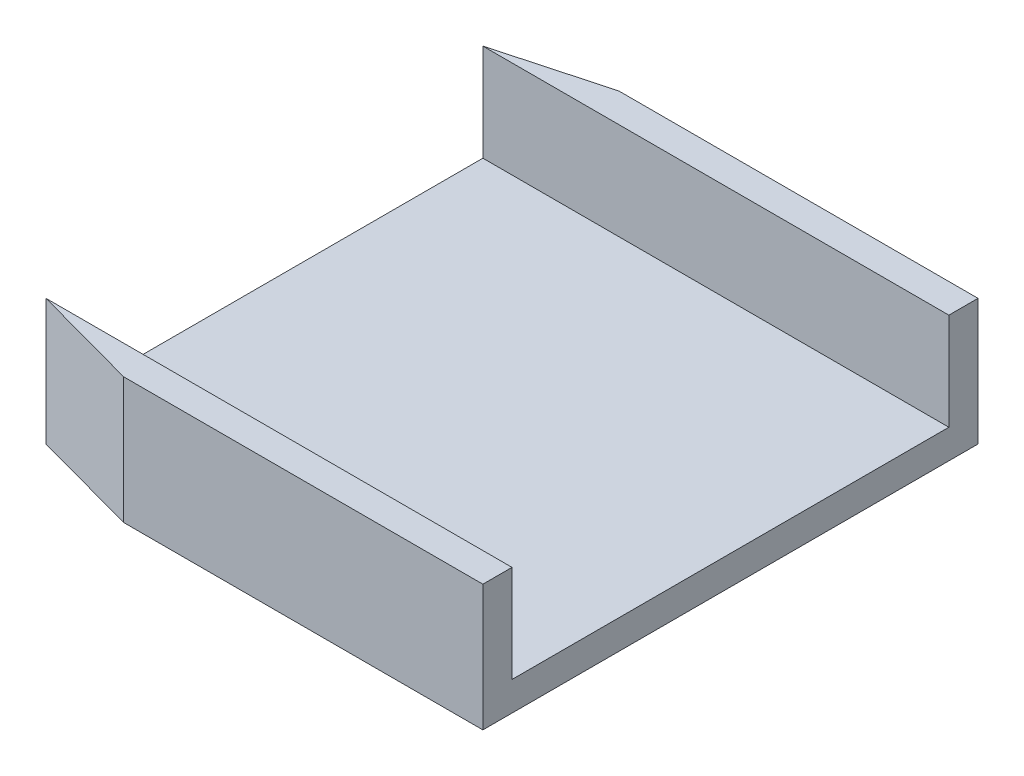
ISO-10303-21;
HEADER;
FILE_DESCRIPTION(('STEP AP214'),'2;1');
FILE_NAME('part.step','',(''),(''),'','','');
FILE_SCHEMA(('AUTOMOTIVE_DESIGN { 1 0 10303 214 1 1 1 1 }'));
ENDSEC;
DATA;
#1=APPLICATION_CONTEXT('core data for automotive mechanical design processes');
#2=APPLICATION_PROTOCOL_DEFINITION('international standard','automotive_design',2000,#1);
#3=PRODUCT_CONTEXT('',#1,'mechanical');
#4=PRODUCT('Part','Part','',(#3));
#5=PRODUCT_RELATED_PRODUCT_CATEGORY('part','',(#4));
#6=PRODUCT_DEFINITION_FORMATION('','',#4);
#7=PRODUCT_DEFINITION_CONTEXT('part definition',#1,'design');
#8=PRODUCT_DEFINITION('design','',#6,#7);
#9=PRODUCT_DEFINITION_SHAPE('','',#8);
#10=(LENGTH_UNIT() NAMED_UNIT(*) SI_UNIT(.MILLI.,.METRE.));
#11=(NAMED_UNIT(*) PLANE_ANGLE_UNIT() SI_UNIT($,.RADIAN.));
#12=(NAMED_UNIT(*) SI_UNIT($,.STERADIAN.) SOLID_ANGLE_UNIT());
#13=UNCERTAINTY_MEASURE_WITH_UNIT(LENGTH_MEASURE(1.E-05),#10,'distance_accuracy_value','');
#14=(GEOMETRIC_REPRESENTATION_CONTEXT(3) GLOBAL_UNCERTAINTY_ASSIGNED_CONTEXT((#13)) GLOBAL_UNIT_ASSIGNED_CONTEXT((#10,
#11,#12)) REPRESENTATION_CONTEXT('',''));
#15=CARTESIAN_POINT('',(0.,0.,0.));
#16=DIRECTION('',(0.,0.,1.));
#17=DIRECTION('',(1.,0.,0.));
#18=AXIS2_PLACEMENT_3D('',#15,#16,#17);
#19=CARTESIAN_POINT('',(0.,3.,0.));
#20=DIRECTION('',(0.,-1.,0.));
#21=DIRECTION('',(0.,0.,-1.));
#22=AXIS2_PLACEMENT_3D('',#19,#20,#21);
#23=PLANE('',#22);
#24=DIRECTION('',(1.,0.,0.));
#25=VECTOR('',#24,1.);
#26=CARTESIAN_POINT('',(48.,3.,-45.));
#27=LINE('',#26,#25);
#28=CARTESIAN_POINT('',(0.,3.,-45.));
#29=VERTEX_POINT('',#28);
#30=CARTESIAN_POINT('',(48.,3.,-45.));
#31=VERTEX_POINT('',#30);
#32=EDGE_CURVE('E124',#29,#31,#27,.T.);
#33=ORIENTED_EDGE('',*,*,#32,.F.);
#34=DIRECTION('',(0.,0.,1.));
#35=VECTOR('',#34,1.);
#36=CARTESIAN_POINT('',(0.,3.,0.));
#37=LINE('',#36,#35);
#38=CARTESIAN_POINT('',(0.,3.,0.));
#39=VERTEX_POINT('',#38);
#40=EDGE_CURVE('E150',#29,#39,#37,.T.);
#41=ORIENTED_EDGE('',*,*,#40,.T.);
#42=DIRECTION('',(-1.,0.,0.));
#43=VECTOR('',#42,1.);
#44=CARTESIAN_POINT('',(0.,3.,0.));
#45=LINE('',#44,#43);
#46=CARTESIAN_POINT('',(48.,3.,0.));
#47=VERTEX_POINT('',#46);
#48=EDGE_CURVE('E53',#47,#39,#45,.T.);
#49=ORIENTED_EDGE('',*,*,#48,.F.);
#50=DIRECTION('',(0.,0.,-1.));
#51=VECTOR('',#50,1.);
#52=CARTESIAN_POINT('',(48.,3.,3.));
#53=LINE('',#52,#51);
#54=EDGE_CURVE('E48',#47,#31,#53,.T.);
#55=ORIENTED_EDGE('',*,*,#54,.T.);
#56=EDGE_LOOP('',(#33,#41,#49,#55));
#57=FACE_BOUND('',#56,.T.);
#58=ADVANCED_FACE('F33',(#57),#23,.F.);
#59=CARTESIAN_POINT('',(0.,3.,0.));
#60=DIRECTION('',(1.,0.,0.));
#61=DIRECTION('',(0.,0.,-1.));
#62=AXIS2_PLACEMENT_3D('',#59,#60,#61);
#63=PLANE('',#62);
#64=DIRECTION('',(0.,0.,1.));
#65=VECTOR('',#64,1.);
#66=CARTESIAN_POINT('',(0.,0.,0.));
#67=LINE('',#66,#65);
#68=CARTESIAN_POINT('',(0.,0.,-45.));
#69=VERTEX_POINT('',#68);
#70=CARTESIAN_POINT('',(0.,0.,0.));
#71=VERTEX_POINT('',#70);
#72=EDGE_CURVE('E149',#69,#71,#67,.T.);
#73=ORIENTED_EDGE('',*,*,#72,.T.);
#74=DIRECTION('',(0.,-1.,0.));
#75=VECTOR('',#74,1.);
#76=CARTESIAN_POINT('',(0.,3.,0.));
#77=LINE('',#76,#75);
#78=EDGE_CURVE('E11',#39,#71,#77,.T.);
#79=ORIENTED_EDGE('',*,*,#78,.F.);
#80=ORIENTED_EDGE('',*,*,#40,.F.);
#81=DIRECTION('',(0.,-1.,0.));
#82=VECTOR('',#81,1.);
#83=CARTESIAN_POINT('',(0.,3.,-45.));
#84=LINE('',#83,#82);
#85=EDGE_CURVE('E154',#29,#69,#84,.T.);
#86=ORIENTED_EDGE('',*,*,#85,.T.);
#87=EDGE_LOOP('',(#73,#79,#80,#86));
#88=FACE_BOUND('',#87,.T.);
#89=ADVANCED_FACE('F35',(#88),#63,.F.);
#90=CARTESIAN_POINT('',(0.,3.,0.));
#91=DIRECTION('',(0.263117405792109,0.,-0.964763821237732));
#92=DIRECTION('',(-0.964763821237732,0.,-0.263117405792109));
#93=AXIS2_PLACEMENT_3D('',#90,#91,#92);
#94=PLANE('',#93);
#95=DIRECTION('',(0.964763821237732,0.,0.263117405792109));
#96=VECTOR('',#95,1.);
#97=CARTESIAN_POINT('',(0.,0.,0.));
#98=LINE('',#97,#96);
#99=CARTESIAN_POINT('',(11.,0.,3.));
#100=VERTEX_POINT('',#99);
#101=EDGE_CURVE('E157',#71,#100,#98,.T.);
#102=ORIENTED_EDGE('',*,*,#101,.T.);
#103=DIRECTION('',(0.,-1.,0.));
#104=VECTOR('',#103,1.);
#105=CARTESIAN_POINT('',(11.,3.,3.));
#106=LINE('',#105,#104);
#107=CARTESIAN_POINT('',(11.,13.,3.));
#108=VERTEX_POINT('',#107);
#109=EDGE_CURVE('E41',#108,#100,#106,.T.);
#110=ORIENTED_EDGE('',*,*,#109,.F.);
#111=DIRECTION('',(0.964763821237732,0.,0.263117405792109));
#112=VECTOR('',#111,1.);
#113=CARTESIAN_POINT('',(11.,13.,3.));
#114=LINE('',#113,#112);
#115=CARTESIAN_POINT('',(0.,13.,0.));
#116=VERTEX_POINT('',#115);
#117=EDGE_CURVE('E129',#116,#108,#114,.T.);
#118=ORIENTED_EDGE('',*,*,#117,.F.);
#119=DIRECTION('',(0.,-1.,0.));
#120=VECTOR('',#119,1.);
#121=CARTESIAN_POINT('',(0.,13.,0.));
#122=LINE('',#121,#120);
#123=EDGE_CURVE('E142',#116,#39,#122,.T.);
#124=ORIENTED_EDGE('',*,*,#123,.T.);
#125=ORIENTED_EDGE('',*,*,#78,.T.);
#126=EDGE_LOOP('',(#102,#110,#118,#124,#125));
#127=FACE_BOUND('',#126,.T.);
#128=ADVANCED_FACE('F201',(#127),#94,.F.);
#129=CARTESIAN_POINT('',(11.,3.,3.));
#130=DIRECTION('',(0.,0.,-1.));
#131=DIRECTION('',(-1.,0.,0.));
#132=AXIS2_PLACEMENT_3D('',#129,#130,#131);
#133=PLANE('',#132);
#134=DIRECTION('',(1.,0.,0.));
#135=VECTOR('',#134,1.);
#136=CARTESIAN_POINT('',(11.,0.,3.));
#137=LINE('',#136,#135);
#138=CARTESIAN_POINT('',(48.,0.,3.));
#139=VERTEX_POINT('',#138);
#140=EDGE_CURVE('E159',#100,#139,#137,.T.);
#141=ORIENTED_EDGE('',*,*,#140,.T.);
#142=DIRECTION('',(0.,-1.,0.));
#143=VECTOR('',#142,1.);
#144=CARTESIAN_POINT('',(48.,3.,3.));
#145=LINE('',#144,#143);
#146=CARTESIAN_POINT('',(48.,13.,3.));
#147=VERTEX_POINT('',#146);
#148=EDGE_CURVE('E173',#147,#139,#145,.T.);
#149=ORIENTED_EDGE('',*,*,#148,.F.);
#150=DIRECTION('',(1.,0.,0.));
#151=VECTOR('',#150,1.);
#152=CARTESIAN_POINT('',(48.,13.,3.));
#153=LINE('',#152,#151);
#154=EDGE_CURVE('E136',#108,#147,#153,.T.);
#155=ORIENTED_EDGE('',*,*,#154,.F.);
#156=ORIENTED_EDGE('',*,*,#109,.T.);
#157=EDGE_LOOP('',(#141,#149,#155,#156));
#158=FACE_BOUND('',#157,.T.);
#159=ADVANCED_FACE('F179',(#158),#133,.F.);
#160=CARTESIAN_POINT('',(48.,3.,-48.));
#161=DIRECTION('',(-1.,0.,0.));
#162=DIRECTION('',(0.,0.,1.));
#163=AXIS2_PLACEMENT_3D('',#160,#161,#162);
#164=PLANE('',#163);
#165=DIRECTION('',(0.,0.,-1.));
#166=VECTOR('',#165,1.);
#167=CARTESIAN_POINT('',(48.,0.,-48.));
#168=LINE('',#167,#166);
#169=CARTESIAN_POINT('',(48.,0.,-48.));
#170=VERTEX_POINT('',#169);
#171=EDGE_CURVE('E162',#139,#170,#168,.T.);
#172=ORIENTED_EDGE('',*,*,#171,.T.);
#173=DIRECTION('',(0.,-1.,0.));
#174=VECTOR('',#173,1.);
#175=CARTESIAN_POINT('',(48.,3.,-48.));
#176=LINE('',#175,#174);
#177=CARTESIAN_POINT('',(48.,13.,-48.));
#178=VERTEX_POINT('',#177);
#179=EDGE_CURVE('E110',#178,#170,#176,.T.);
#180=ORIENTED_EDGE('',*,*,#179,.F.);
#181=DIRECTION('',(0.,0.,-1.));
#182=VECTOR('',#181,1.);
#183=CARTESIAN_POINT('',(48.,13.,-48.));
#184=LINE('',#183,#182);
#185=CARTESIAN_POINT('',(48.,13.,-45.));
#186=VERTEX_POINT('',#185);
#187=EDGE_CURVE('E103',#186,#178,#184,.T.);
#188=ORIENTED_EDGE('',*,*,#187,.F.);
#189=DIRECTION('',(0.,-1.,0.));
#190=VECTOR('',#189,1.);
#191=CARTESIAN_POINT('',(48.,13.,-45.));
#192=LINE('',#191,#190);
#193=EDGE_CURVE('E107',#186,#31,#192,.T.);
#194=ORIENTED_EDGE('',*,*,#193,.T.);
#195=ORIENTED_EDGE('',*,*,#54,.F.);
#196=DIRECTION('',(0.,-1.,0.));
#197=VECTOR('',#196,1.);
#198=CARTESIAN_POINT('',(48.,13.,0.));
#199=LINE('',#198,#197);
#200=CARTESIAN_POINT('',(48.,13.,0.));
#201=VERTEX_POINT('',#200);
#202=EDGE_CURVE('E146',#201,#47,#199,.T.);
#203=ORIENTED_EDGE('',*,*,#202,.F.);
#204=DIRECTION('',(0.,0.,-1.));
#205=VECTOR('',#204,1.);
#206=CARTESIAN_POINT('',(48.,13.,0.));
#207=LINE('',#206,#205);
#208=EDGE_CURVE('E139',#147,#201,#207,.T.);
#209=ORIENTED_EDGE('',*,*,#208,.F.);
#210=ORIENTED_EDGE('',*,*,#148,.T.);
#211=EDGE_LOOP('',(#172,#180,#188,#194,#195,#203,#209,#210));
#212=FACE_BOUND('',#211,.T.);
#213=ADVANCED_FACE('F105',(#212),#164,.F.);
#214=CARTESIAN_POINT('',(11.,3.,-48.));
#215=DIRECTION('',(0.,0.,1.));
#216=DIRECTION('',(1.,0.,0.));
#217=AXIS2_PLACEMENT_3D('',#214,#215,#216);
#218=PLANE('',#217);
#219=DIRECTION('',(-1.,0.,0.));
#220=VECTOR('',#219,1.);
#221=CARTESIAN_POINT('',(11.,0.,-48.));
#222=LINE('',#221,#220);
#223=CARTESIAN_POINT('',(11.,0.,-48.));
#224=VERTEX_POINT('',#223);
#225=EDGE_CURVE('E164',#170,#224,#222,.T.);
#226=ORIENTED_EDGE('',*,*,#225,.T.);
#227=DIRECTION('',(0.,-1.,0.));
#228=VECTOR('',#227,1.);
#229=CARTESIAN_POINT('',(11.,3.,-48.));
#230=LINE('',#229,#228);
#231=CARTESIAN_POINT('',(11.,13.,-48.));
#232=VERTEX_POINT('',#231);
#233=EDGE_CURVE('E169',#232,#224,#230,.T.);
#234=ORIENTED_EDGE('',*,*,#233,.F.);
#235=DIRECTION('',(-1.,0.,0.));
#236=VECTOR('',#235,1.);
#237=CARTESIAN_POINT('',(11.,13.,-48.));
#238=LINE('',#237,#236);
#239=EDGE_CURVE('E114',#178,#232,#238,.T.);
#240=ORIENTED_EDGE('',*,*,#239,.F.);
#241=ORIENTED_EDGE('',*,*,#179,.T.);
#242=EDGE_LOOP('',(#226,#234,#240,#241));
#243=FACE_BOUND('',#242,.T.);
#244=ADVANCED_FACE('F189',(#243),#218,.F.);
#245=CARTESIAN_POINT('',(0.,3.,-45.));
#246=DIRECTION('',(0.263117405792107,0.,0.964763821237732));
#247=DIRECTION('',(0.964763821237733,0.,-0.263117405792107));
#248=AXIS2_PLACEMENT_3D('',#245,#246,#247);
#249=PLANE('',#248);
#250=DIRECTION('',(-0.964763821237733,0.,0.263117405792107));
#251=VECTOR('',#250,1.);
#252=CARTESIAN_POINT('',(0.,0.,-45.));
#253=LINE('',#252,#251);
#254=EDGE_CURVE('E152',#224,#69,#253,.T.);
#255=ORIENTED_EDGE('',*,*,#254,.T.);
#256=ORIENTED_EDGE('',*,*,#85,.F.);
#257=DIRECTION('',(0.,-1.,0.));
#258=VECTOR('',#257,1.);
#259=CARTESIAN_POINT('',(0.,13.,-45.));
#260=LINE('',#259,#258);
#261=CARTESIAN_POINT('',(0.,13.,-45.));
#262=VERTEX_POINT('',#261);
#263=EDGE_CURVE('E127',#262,#29,#260,.T.);
#264=ORIENTED_EDGE('',*,*,#263,.F.);
#265=DIRECTION('',(-0.964763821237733,0.,0.263117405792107));
#266=VECTOR('',#265,1.);
#267=CARTESIAN_POINT('',(0.,13.,-45.));
#268=LINE('',#267,#266);
#269=EDGE_CURVE('E120',#232,#262,#268,.T.);
#270=ORIENTED_EDGE('',*,*,#269,.F.);
#271=ORIENTED_EDGE('',*,*,#233,.T.);
#272=EDGE_LOOP('',(#255,#256,#264,#270,#271));
#273=FACE_BOUND('',#272,.T.);
#274=ADVANCED_FACE('F193',(#273),#249,.F.);
#275=CARTESIAN_POINT('',(0.,0.,0.));
#276=DIRECTION('',(0.,-1.,0.));
#277=DIRECTION('',(0.,0.,-1.));
#278=AXIS2_PLACEMENT_3D('',#275,#276,#277);
#279=PLANE('',#278);
#280=ORIENTED_EDGE('',*,*,#72,.F.);
#281=ORIENTED_EDGE('',*,*,#254,.F.);
#282=ORIENTED_EDGE('',*,*,#225,.F.);
#283=ORIENTED_EDGE('',*,*,#171,.F.);
#284=ORIENTED_EDGE('',*,*,#140,.F.);
#285=ORIENTED_EDGE('',*,*,#101,.F.);
#286=EDGE_LOOP('',(#280,#281,#282,#283,#284,#285));
#287=FACE_BOUND('',#286,.T.);
#288=ADVANCED_FACE('F184',(#287),#279,.T.);
#289=CARTESIAN_POINT('',(0.,13.,0.));
#290=DIRECTION('',(0.,0.,1.));
#291=DIRECTION('',(1.,0.,0.));
#292=AXIS2_PLACEMENT_3D('',#289,#290,#291);
#293=PLANE('',#292);
#294=ORIENTED_EDGE('',*,*,#48,.T.);
#295=ORIENTED_EDGE('',*,*,#123,.F.);
#296=DIRECTION('',(-1.,0.,0.));
#297=VECTOR('',#296,1.);
#298=CARTESIAN_POINT('',(0.,13.,0.));
#299=LINE('',#298,#297);
#300=EDGE_CURVE('E141',#201,#116,#299,.T.);
#301=ORIENTED_EDGE('',*,*,#300,.F.);
#302=ORIENTED_EDGE('',*,*,#202,.T.);
#303=EDGE_LOOP('',(#294,#295,#301,#302));
#304=FACE_BOUND('',#303,.T.);
#305=ADVANCED_FACE('F198',(#304),#293,.F.);
#306=CARTESIAN_POINT('',(0.,13.,0.));
#307=DIRECTION('',(0.,1.,0.));
#308=DIRECTION('',(0.,0.,1.));
#309=AXIS2_PLACEMENT_3D('',#306,#307,#308);
#310=PLANE('',#309);
#311=ORIENTED_EDGE('',*,*,#117,.T.);
#312=ORIENTED_EDGE('',*,*,#154,.T.);
#313=ORIENTED_EDGE('',*,*,#208,.T.);
#314=ORIENTED_EDGE('',*,*,#300,.T.);
#315=EDGE_LOOP('',(#311,#312,#313,#314));
#316=FACE_BOUND('',#315,.T.);
#317=ADVANCED_FACE('F203',(#316),#310,.T.);
#318=CARTESIAN_POINT('',(48.,13.,-45.));
#319=DIRECTION('',(0.,0.,-1.));
#320=DIRECTION('',(-1.,0.,0.));
#321=AXIS2_PLACEMENT_3D('',#318,#319,#320);
#322=PLANE('',#321);
#323=ORIENTED_EDGE('',*,*,#32,.T.);
#324=ORIENTED_EDGE('',*,*,#193,.F.);
#325=DIRECTION('',(1.,0.,0.));
#326=VECTOR('',#325,1.);
#327=CARTESIAN_POINT('',(48.,13.,-45.));
#328=LINE('',#327,#326);
#329=EDGE_CURVE('E115',#262,#186,#328,.T.);
#330=ORIENTED_EDGE('',*,*,#329,.F.);
#331=ORIENTED_EDGE('',*,*,#263,.T.);
#332=EDGE_LOOP('',(#323,#324,#330,#331));
#333=FACE_BOUND('',#332,.T.);
#334=ADVANCED_FACE('F126',(#333),#322,.F.);
#335=CARTESIAN_POINT('',(0.,13.,0.));
#336=DIRECTION('',(0.,1.,0.));
#337=DIRECTION('',(0.,0.,1.));
#338=AXIS2_PLACEMENT_3D('',#335,#336,#337);
#339=PLANE('',#338);
#340=ORIENTED_EDGE('',*,*,#329,.T.);
#341=ORIENTED_EDGE('',*,*,#187,.T.);
#342=ORIENTED_EDGE('',*,*,#239,.T.);
#343=ORIENTED_EDGE('',*,*,#269,.T.);
#344=EDGE_LOOP('',(#340,#341,#342,#343));
#345=FACE_BOUND('',#344,.T.);
#346=ADVANCED_FACE('F118',(#345),#339,.T.);
#347=CLOSED_SHELL('',(#58,#89,#128,#159,#213,#244,#274,#288,#305,#317,#334,#346));
#348=MANIFOLD_SOLID_BREP('B2',#347);
#349=ADVANCED_BREP_SHAPE_REPRESENTATION('',(#18,#348),#14);
#350=SHAPE_DEFINITION_REPRESENTATION(#9,#349);
ENDSEC;
END-ISO-10303-21;
